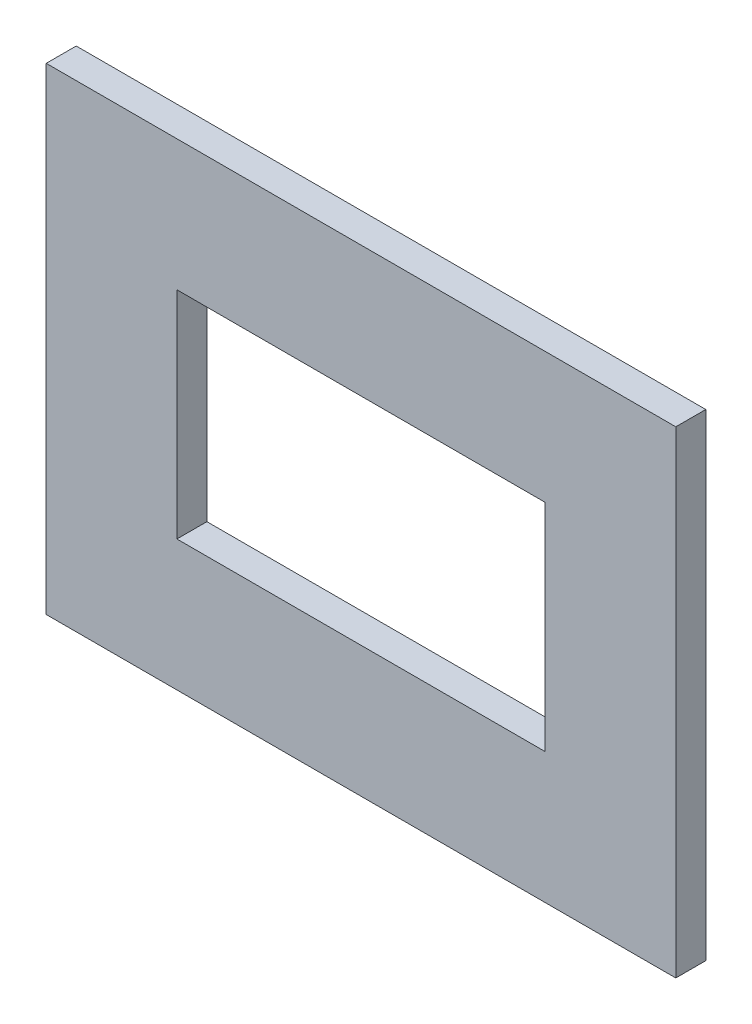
ISO-10303-21;
HEADER;
FILE_DESCRIPTION(('STEP AP214'),'2;1');
FILE_NAME('part.step','',(''),(''),'','','');
FILE_SCHEMA(('AUTOMOTIVE_DESIGN { 1 0 10303 214 1 1 1 1 }'));
ENDSEC;
DATA;
#1=APPLICATION_CONTEXT('core data for automotive mechanical design processes');
#2=APPLICATION_PROTOCOL_DEFINITION('international standard','automotive_design',2000,#1);
#3=PRODUCT_CONTEXT('',#1,'mechanical');
#4=PRODUCT('Part','Part','',(#3));
#5=PRODUCT_RELATED_PRODUCT_CATEGORY('part','',(#4));
#6=PRODUCT_DEFINITION_FORMATION('','',#4);
#7=PRODUCT_DEFINITION_CONTEXT('part definition',#1,'design');
#8=PRODUCT_DEFINITION('design','',#6,#7);
#9=PRODUCT_DEFINITION_SHAPE('','',#8);
#10=(LENGTH_UNIT() NAMED_UNIT(*) SI_UNIT(.MILLI.,.METRE.));
#11=(NAMED_UNIT(*) PLANE_ANGLE_UNIT() SI_UNIT($,.RADIAN.));
#12=(NAMED_UNIT(*) SI_UNIT($,.STERADIAN.) SOLID_ANGLE_UNIT());
#13=UNCERTAINTY_MEASURE_WITH_UNIT(LENGTH_MEASURE(1.E-05),#10,'distance_accuracy_value','');
#14=(GEOMETRIC_REPRESENTATION_CONTEXT(3) GLOBAL_UNCERTAINTY_ASSIGNED_CONTEXT((#13)) GLOBAL_UNIT_ASSIGNED_CONTEXT((#10,
#11,#12)) REPRESENTATION_CONTEXT('',''));
#15=CARTESIAN_POINT('',(0.,0.,0.));
#16=DIRECTION('',(0.,0.,1.));
#17=DIRECTION('',(1.,0.,0.));
#18=AXIS2_PLACEMENT_3D('',#15,#16,#17);
#19=CARTESIAN_POINT('',(0.,0.,15.));
#20=DIRECTION('',(0.,0.,1.));
#21=DIRECTION('',(1.,0.,0.));
#22=AXIS2_PLACEMENT_3D('',#19,#20,#21);
#23=PLANE('',#22);
#24=DIRECTION('',(1.,0.,0.));
#25=VECTOR('',#24,1.);
#26=CARTESIAN_POINT('',(92.075,-53.975,15.));
#27=LINE('',#26,#25);
#28=CARTESIAN_POINT('',(-92.0750000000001,-53.975,15.));
#29=VERTEX_POINT('',#28);
#30=CARTESIAN_POINT('',(92.075,-53.975,15.));
#31=VERTEX_POINT('',#30);
#32=EDGE_CURVE('E134',#29,#31,#27,.T.);
#33=ORIENTED_EDGE('',*,*,#32,.F.);
#34=DIRECTION('',(0.,-1.,0.));
#35=VECTOR('',#34,1.);
#36=CARTESIAN_POINT('',(-92.0750000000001,-53.975,15.));
#37=LINE('',#36,#35);
#38=CARTESIAN_POINT('',(-92.0750000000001,53.975,15.));
#39=VERTEX_POINT('',#38);
#40=EDGE_CURVE('E132',#39,#29,#37,.T.);
#41=ORIENTED_EDGE('',*,*,#40,.F.);
#42=DIRECTION('',(-1.,0.,0.));
#43=VECTOR('',#42,1.);
#44=CARTESIAN_POINT('',(92.075,53.975,15.));
#45=LINE('',#44,#43);
#46=CARTESIAN_POINT('',(92.075,53.975,15.));
#47=VERTEX_POINT('',#46);
#48=EDGE_CURVE('E140',#47,#39,#45,.T.);
#49=ORIENTED_EDGE('',*,*,#48,.F.);
#50=DIRECTION('',(0.,1.,0.));
#51=VECTOR('',#50,1.);
#52=CARTESIAN_POINT('',(92.075,-53.975,15.));
#53=LINE('',#52,#51);
#54=EDGE_CURVE('E137',#31,#47,#53,.T.);
#55=ORIENTED_EDGE('',*,*,#54,.F.);
#56=EDGE_LOOP('',(#33,#41,#49,#55));
#57=FACE_BOUND('',#56,.T.);
#58=DIRECTION('',(-1.,0.,0.));
#59=VECTOR('',#58,1.);
#60=CARTESIAN_POINT('',(0.,119.375,15.));
#61=LINE('',#60,#59);
#62=CARTESIAN_POINT('',(157.439078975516,119.375,15.));
#63=VERTEX_POINT('',#62);
#64=CARTESIAN_POINT('',(-157.439078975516,119.375,15.));
#65=VERTEX_POINT('',#64);
#66=EDGE_CURVE('E109',#63,#65,#61,.T.);
#67=ORIENTED_EDGE('',*,*,#66,.T.);
#68=DIRECTION('',(0.,1.,0.));
#69=VECTOR('',#68,1.);
#70=CARTESIAN_POINT('',(-157.439078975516,0.,15.));
#71=LINE('',#70,#69);
#72=CARTESIAN_POINT('',(-157.439078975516,-119.375,15.));
#73=VERTEX_POINT('',#72);
#74=EDGE_CURVE('E105',#73,#65,#71,.T.);
#75=ORIENTED_EDGE('',*,*,#74,.F.);
#76=DIRECTION('',(-1.,0.,0.));
#77=VECTOR('',#76,1.);
#78=CARTESIAN_POINT('',(0.,-119.375,15.));
#79=LINE('',#78,#77);
#80=CARTESIAN_POINT('',(157.439078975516,-119.375,15.));
#81=VERTEX_POINT('',#80);
#82=EDGE_CURVE('E97',#81,#73,#79,.T.);
#83=ORIENTED_EDGE('',*,*,#82,.F.);
#84=DIRECTION('',(0.,1.,0.));
#85=VECTOR('',#84,1.);
#86=CARTESIAN_POINT('',(157.439078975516,0.,15.));
#87=LINE('',#86,#85);
#88=EDGE_CURVE('E47',#81,#63,#87,.T.);
#89=ORIENTED_EDGE('',*,*,#88,.T.);
#90=EDGE_LOOP('',(#67,#75,#83,#89));
#91=FACE_BOUND('',#90,.T.);
#92=ADVANCED_FACE('F32',(#57,#91),#23,.T.);
#93=CARTESIAN_POINT('',(0.,0.,0.));
#94=DIRECTION('',(0.,0.,1.));
#95=DIRECTION('',(1.,0.,0.));
#96=AXIS2_PLACEMENT_3D('',#93,#94,#95);
#97=PLANE('',#96);
#98=DIRECTION('',(0.,-1.,0.));
#99=VECTOR('',#98,1.);
#100=CARTESIAN_POINT('',(-92.0750000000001,-53.975,0.));
#101=LINE('',#100,#99);
#102=CARTESIAN_POINT('',(-92.0750000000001,53.975,0.));
#103=VERTEX_POINT('',#102);
#104=CARTESIAN_POINT('',(-92.0750000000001,-53.975,0.));
#105=VERTEX_POINT('',#104);
#106=EDGE_CURVE('E128',#103,#105,#101,.T.);
#107=ORIENTED_EDGE('',*,*,#106,.T.);
#108=DIRECTION('',(1.,0.,0.));
#109=VECTOR('',#108,1.);
#110=CARTESIAN_POINT('',(92.075,-53.975,0.));
#111=LINE('',#110,#109);
#112=CARTESIAN_POINT('',(92.075,-53.975,0.));
#113=VERTEX_POINT('',#112);
#114=EDGE_CURVE('E145',#105,#113,#111,.T.);
#115=ORIENTED_EDGE('',*,*,#114,.T.);
#116=DIRECTION('',(0.,1.,0.));
#117=VECTOR('',#116,1.);
#118=CARTESIAN_POINT('',(92.075,-53.975,0.));
#119=LINE('',#118,#117);
#120=CARTESIAN_POINT('',(92.075,53.975,0.));
#121=VERTEX_POINT('',#120);
#122=EDGE_CURVE('E148',#113,#121,#119,.T.);
#123=ORIENTED_EDGE('',*,*,#122,.T.);
#124=DIRECTION('',(-1.,0.,0.));
#125=VECTOR('',#124,1.);
#126=CARTESIAN_POINT('',(92.075,53.975,0.));
#127=LINE('',#126,#125);
#128=EDGE_CURVE('E135',#121,#103,#127,.T.);
#129=ORIENTED_EDGE('',*,*,#128,.T.);
#130=EDGE_LOOP('',(#107,#115,#123,#129));
#131=FACE_BOUND('',#130,.T.);
#132=DIRECTION('',(0.,1.,0.));
#133=VECTOR('',#132,1.);
#134=CARTESIAN_POINT('',(-157.439078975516,0.,0.));
#135=LINE('',#134,#133);
#136=CARTESIAN_POINT('',(-157.439078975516,-119.375,0.));
#137=VERTEX_POINT('',#136);
#138=CARTESIAN_POINT('',(-157.439078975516,119.375,0.));
#139=VERTEX_POINT('',#138);
#140=EDGE_CURVE('E55',#137,#139,#135,.T.);
#141=ORIENTED_EDGE('',*,*,#140,.T.);
#142=DIRECTION('',(-1.,0.,0.));
#143=VECTOR('',#142,1.);
#144=CARTESIAN_POINT('',(0.,119.375,0.));
#145=LINE('',#144,#143);
#146=CARTESIAN_POINT('',(157.439078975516,119.375,0.));
#147=VERTEX_POINT('',#146);
#148=EDGE_CURVE('E113',#147,#139,#145,.T.);
#149=ORIENTED_EDGE('',*,*,#148,.F.);
#150=DIRECTION('',(0.,1.,0.));
#151=VECTOR('',#150,1.);
#152=CARTESIAN_POINT('',(157.439078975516,0.,0.));
#153=LINE('',#152,#151);
#154=CARTESIAN_POINT('',(157.439078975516,-119.375,0.));
#155=VERTEX_POINT('',#154);
#156=EDGE_CURVE('E116',#155,#147,#153,.T.);
#157=ORIENTED_EDGE('',*,*,#156,.F.);
#158=DIRECTION('',(-1.,0.,0.));
#159=VECTOR('',#158,1.);
#160=CARTESIAN_POINT('',(0.,-119.375,0.));
#161=LINE('',#160,#159);
#162=EDGE_CURVE('E122',#155,#137,#161,.T.);
#163=ORIENTED_EDGE('',*,*,#162,.T.);
#164=EDGE_LOOP('',(#141,#149,#157,#163));
#165=FACE_BOUND('',#164,.T.);
#166=ADVANCED_FACE('F34',(#131,#165),#97,.F.);
#167=CARTESIAN_POINT('',(-92.0750000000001,-53.975,15.));
#168=DIRECTION('',(1.,0.,0.));
#169=DIRECTION('',(0.,0.,-1.));
#170=AXIS2_PLACEMENT_3D('',#167,#168,#169);
#171=PLANE('',#170);
#172=ORIENTED_EDGE('',*,*,#106,.F.);
#173=DIRECTION('',(0.,0.,-1.));
#174=VECTOR('',#173,1.);
#175=CARTESIAN_POINT('',(-92.0750000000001,53.975,15.));
#176=LINE('',#175,#174);
#177=EDGE_CURVE('E142',#39,#103,#176,.T.);
#178=ORIENTED_EDGE('',*,*,#177,.F.);
#179=ORIENTED_EDGE('',*,*,#40,.T.);
#180=DIRECTION('',(0.,0.,-1.));
#181=VECTOR('',#180,1.);
#182=CARTESIAN_POINT('',(-92.0750000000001,-53.975,15.));
#183=LINE('',#182,#181);
#184=EDGE_CURVE('E11',#29,#105,#183,.T.);
#185=ORIENTED_EDGE('',*,*,#184,.T.);
#186=EDGE_LOOP('',(#172,#178,#179,#185));
#187=FACE_BOUND('',#186,.T.);
#188=ADVANCED_FACE('F170',(#187),#171,.T.);
#189=CARTESIAN_POINT('',(92.075,-53.975,15.));
#190=DIRECTION('',(0.,1.,0.));
#191=DIRECTION('',(-1.,0.,0.));
#192=AXIS2_PLACEMENT_3D('',#189,#190,#191);
#193=PLANE('',#192);
#194=ORIENTED_EDGE('',*,*,#114,.F.);
#195=ORIENTED_EDGE('',*,*,#184,.F.);
#196=ORIENTED_EDGE('',*,*,#32,.T.);
#197=DIRECTION('',(0.,0.,-1.));
#198=VECTOR('',#197,1.);
#199=CARTESIAN_POINT('',(92.075,-53.975,15.));
#200=LINE('',#199,#198);
#201=EDGE_CURVE('E40',#31,#113,#200,.T.);
#202=ORIENTED_EDGE('',*,*,#201,.T.);
#203=EDGE_LOOP('',(#194,#195,#196,#202));
#204=FACE_BOUND('',#203,.T.);
#205=ADVANCED_FACE('F159',(#204),#193,.T.);
#206=CARTESIAN_POINT('',(92.075,-53.975,15.));
#207=DIRECTION('',(-1.,0.,0.));
#208=DIRECTION('',(0.,0.,1.));
#209=AXIS2_PLACEMENT_3D('',#206,#207,#208);
#210=PLANE('',#209);
#211=ORIENTED_EDGE('',*,*,#122,.F.);
#212=ORIENTED_EDGE('',*,*,#201,.F.);
#213=ORIENTED_EDGE('',*,*,#54,.T.);
#214=DIRECTION('',(0.,0.,-1.));
#215=VECTOR('',#214,1.);
#216=CARTESIAN_POINT('',(92.075,53.975,15.));
#217=LINE('',#216,#215);
#218=EDGE_CURVE('E155',#47,#121,#217,.T.);
#219=ORIENTED_EDGE('',*,*,#218,.T.);
#220=EDGE_LOOP('',(#211,#212,#213,#219));
#221=FACE_BOUND('',#220,.T.);
#222=ADVANCED_FACE('F164',(#221),#210,.T.);
#223=CARTESIAN_POINT('',(92.075,53.975,15.));
#224=DIRECTION('',(0.,-1.,0.));
#225=DIRECTION('',(1.,0.,0.));
#226=AXIS2_PLACEMENT_3D('',#223,#224,#225);
#227=PLANE('',#226);
#228=ORIENTED_EDGE('',*,*,#128,.F.);
#229=ORIENTED_EDGE('',*,*,#218,.F.);
#230=ORIENTED_EDGE('',*,*,#48,.T.);
#231=ORIENTED_EDGE('',*,*,#177,.T.);
#232=EDGE_LOOP('',(#228,#229,#230,#231));
#233=FACE_BOUND('',#232,.T.);
#234=ADVANCED_FACE('F173',(#233),#227,.T.);
#235=CARTESIAN_POINT('',(-157.439078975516,0.,15.));
#236=DIRECTION('',(-1.,0.,0.));
#237=DIRECTION('',(0.,0.,1.));
#238=AXIS2_PLACEMENT_3D('',#235,#236,#237);
#239=PLANE('',#238);
#240=ORIENTED_EDGE('',*,*,#140,.F.);
#241=DIRECTION('',(0.,0.,-1.));
#242=VECTOR('',#241,1.);
#243=CARTESIAN_POINT('',(-157.439078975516,-119.375,15.));
#244=LINE('',#243,#242);
#245=EDGE_CURVE('E100',#73,#137,#244,.T.);
#246=ORIENTED_EDGE('',*,*,#245,.F.);
#247=ORIENTED_EDGE('',*,*,#74,.T.);
#248=DIRECTION('',(0.,0.,-1.));
#249=VECTOR('',#248,1.);
#250=CARTESIAN_POINT('',(-157.439078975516,119.375,15.));
#251=LINE('',#250,#249);
#252=EDGE_CURVE('E126',#65,#139,#251,.T.);
#253=ORIENTED_EDGE('',*,*,#252,.T.);
#254=EDGE_LOOP('',(#240,#246,#247,#253));
#255=FACE_BOUND('',#254,.T.);
#256=ADVANCED_FACE('F107',(#255),#239,.T.);
#257=CARTESIAN_POINT('',(0.,119.375,15.));
#258=DIRECTION('',(0.,-1.,0.));
#259=DIRECTION('',(0.,0.,-1.));
#260=AXIS2_PLACEMENT_3D('',#257,#258,#259);
#261=PLANE('',#260);
#262=ORIENTED_EDGE('',*,*,#148,.T.);
#263=ORIENTED_EDGE('',*,*,#252,.F.);
#264=ORIENTED_EDGE('',*,*,#66,.F.);
#265=DIRECTION('',(0.,0.,-1.));
#266=VECTOR('',#265,1.);
#267=CARTESIAN_POINT('',(157.439078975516,119.375,15.));
#268=LINE('',#267,#266);
#269=EDGE_CURVE('E129',#63,#147,#268,.T.);
#270=ORIENTED_EDGE('',*,*,#269,.T.);
#271=EDGE_LOOP('',(#262,#263,#264,#270));
#272=FACE_BOUND('',#271,.T.);
#273=ADVANCED_FACE('F192',(#272),#261,.F.);
#274=CARTESIAN_POINT('',(157.439078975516,0.,15.));
#275=DIRECTION('',(-1.,0.,0.));
#276=DIRECTION('',(0.,0.,1.));
#277=AXIS2_PLACEMENT_3D('',#274,#275,#276);
#278=PLANE('',#277);
#279=ORIENTED_EDGE('',*,*,#156,.T.);
#280=ORIENTED_EDGE('',*,*,#269,.F.);
#281=ORIENTED_EDGE('',*,*,#88,.F.);
#282=DIRECTION('',(0.,0.,-1.));
#283=VECTOR('',#282,1.);
#284=CARTESIAN_POINT('',(157.439078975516,-119.375,15.));
#285=LINE('',#284,#283);
#286=EDGE_CURVE('E102',#81,#155,#285,.T.);
#287=ORIENTED_EDGE('',*,*,#286,.T.);
#288=EDGE_LOOP('',(#279,#280,#281,#287));
#289=FACE_BOUND('',#288,.T.);
#290=ADVANCED_FACE('F195',(#289),#278,.F.);
#291=CARTESIAN_POINT('',(0.,-119.375,15.));
#292=DIRECTION('',(0.,-1.,0.));
#293=DIRECTION('',(0.,0.,-1.));
#294=AXIS2_PLACEMENT_3D('',#291,#292,#293);
#295=PLANE('',#294);
#296=ORIENTED_EDGE('',*,*,#162,.F.);
#297=ORIENTED_EDGE('',*,*,#286,.F.);
#298=ORIENTED_EDGE('',*,*,#82,.T.);
#299=ORIENTED_EDGE('',*,*,#245,.T.);
#300=EDGE_LOOP('',(#296,#297,#298,#299));
#301=FACE_BOUND('',#300,.T.);
#302=ADVANCED_FACE('F99',(#301),#295,.T.);
#303=CLOSED_SHELL('',(#92,#166,#188,#205,#222,#234,#256,#273,#290,#302));
#304=MANIFOLD_SOLID_BREP('B2',#303);
#305=ADVANCED_BREP_SHAPE_REPRESENTATION('',(#18,#304),#14);
#306=SHAPE_DEFINITION_REPRESENTATION(#9,#305);
ENDSEC;
END-ISO-10303-21;
